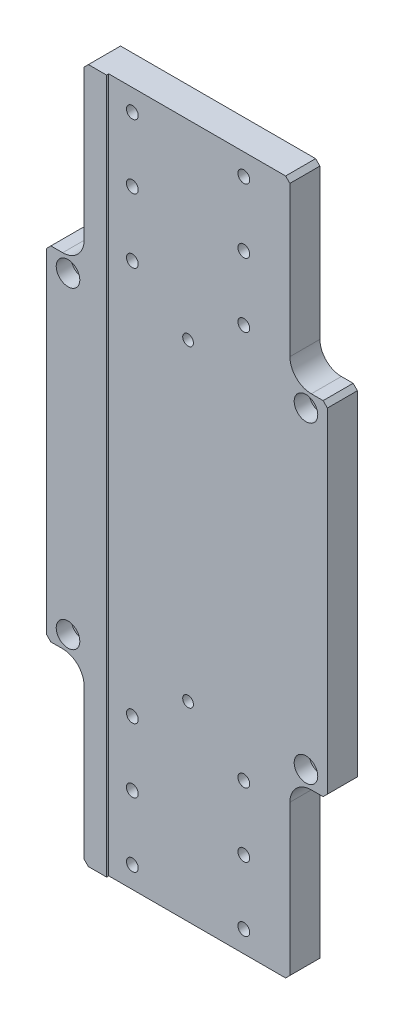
from build123d import *

# Parameters (mm, degrees)
EXTRUDE_1_DEPTH              = 7.5
SKETCH_2_W                   = 102
SKETCH_2_H                   = 324
CUT_EXTRUDE_1_DEPTH          = 1
F_5_0MM_1_D                  = 5
HOLE_WIZARD_M6_1_D           = 6.6
HOLE_WIZARD_M6_1_CBORE_D     = 11
HOLE_WIZARD_M6_1_CBORE_DEPTH = 7
HOLE_WIZARD_M6_2_D           = 6.6
HOLE_WIZARD_M6_2_CBORE_D     = 11
HOLE_WIZARD_M6_2_CBORE_DEPTH = 7
HOLE_WIZARD_M5_1_D           = 5.5
HOLE_WIZARD_M5_1_CBORE_D     = 9.5
HOLE_WIZARD_M5_1_CBORE_DEPTH = 8
PATTERN_LINEAR_1_COUNT       = 2
PATTERN_LINEAR_1_PITCH       = 244
FILLET_1_R                   = 10
CHAMFER_1_SIZE               = 2


with BuildPart() as part:
    # Sketch 1 → Extrude 1 (new, symmetric)
    with BuildSketch(Plane.XY):
        Polygon((47.5, 80), (65, 80), (65, -80), (47.5, -80), (47.5, -162), (-47.5, -162), (-47.5, -80), (-65, -80), (-65, 80), (-47.5, 80), (-47.5, 162), (47.5, 162), align=None)
    extrude(amount=EXTRUDE_1_DEPTH, both=True)

    # Sketch 2 → Cut-Extrude 1 (cut)
    with BuildSketch(Plane.XY.offset(7.5)):
        with Locations((14, 0)):
            Rectangle(SKETCH_2_W, SKETCH_2_H)
    extrude(amount=-CUT_EXTRUDE_1_DEPTH, mode=Mode.SUBTRACT)

    # 5.0mm _ _1 (through all)
    with Locations(Plane.XY.offset(6.5)):
        with Locations((0, -73), (0, 73)):
            Hole(F_5_0MM_1_D / 2)

    # Hole Wizard M6 _ _ _ _ _1 (through all)
    with Locations(Plane.XY.offset(7.5)):
        with Locations((-55, 73), (-55, -73)):
            CounterBoreHole(HOLE_WIZARD_M6_1_D / 2, HOLE_WIZARD_M6_1_CBORE_D / 2, HOLE_WIZARD_M6_1_CBORE_DEPTH)

    # Hole Wizard M6 _ _ _ _ _2 (through all)
    with Locations(Plane.XY.offset(6.5)):
        with Locations((55, 73), (55, -73)):
            CounterBoreHole(HOLE_WIZARD_M6_2_D / 2, HOLE_WIZARD_M6_2_CBORE_D / 2, HOLE_WIZARD_M6_2_CBORE_DEPTH)

    # Hole Wizard M5 _ _ _ _ _1 (through all)
    with Locations(Plane(origin=(0, 0, -7.5), x_dir=(-1, 0, 0), z_dir=(0, 0, -1))):
        with Locations((-26, 152), (26, 152), (-26, 122), (26, 122), (-26, 92), (26, 92)):
            hole_wizard_m5_1 = CounterBoreHole(HOLE_WIZARD_M5_1_D / 2, HOLE_WIZARD_M5_1_CBORE_D / 2, HOLE_WIZARD_M5_1_CBORE_DEPTH)

    # Pattern Linear 1: Hole Wizard M5 _ _ _ _ _1 ×2
    with Locations(*[(0, -i * PATTERN_LINEAR_1_PITCH, 0) for i in range(1, PATTERN_LINEAR_1_COUNT)]):
        add(hole_wizard_m5_1, mode=Mode.SUBTRACT)

    # Fillet 1
    fillet_1_edges = [part.edges().sort_by_distance(p)[0] for p in [
        (-47.5, 80, 0),
        (-47.5, -80, 0),
        (47.5, 80, -0.5),
        (47.5, -80, -0.5),
    ]]
    fillet(fillet_1_edges, radius=FILLET_1_R)

    # Chamfer 1
    chamfer_1_edges = [part.edges().sort_by_distance(p)[0] for p in [
        (-65, 80, 0),
        (-47.5, 162, 0),
        (-47.5, -162, 0),
        (-65, -80, 0),
        (47.5, 162, -0.5),
        (65, 80, -0.5),
        (65, -80, -0.5),
        (47.5, -162, -0.5),
    ]]
    chamfer(chamfer_1_edges, length=CHAMFER_1_SIZE)


solid = part.part
